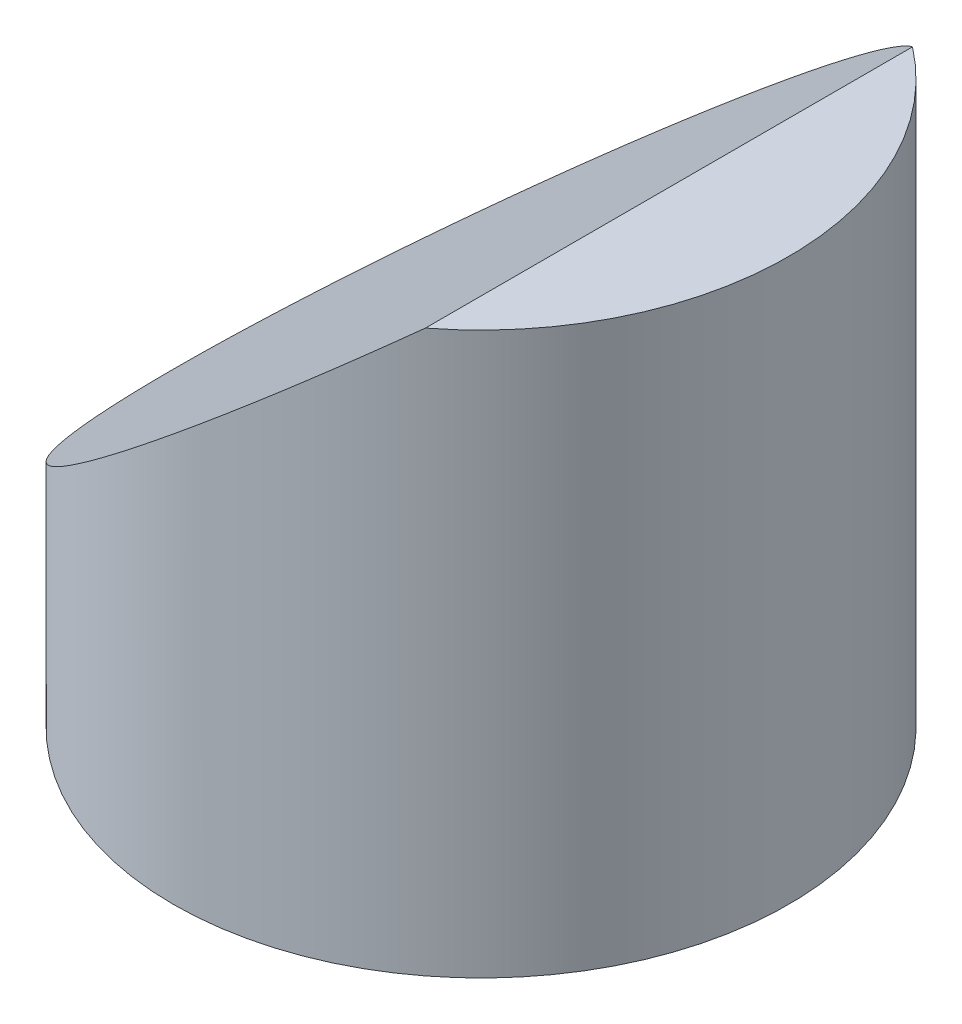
ISO-10303-21;
HEADER;
FILE_DESCRIPTION(('STEP AP214'),'2;1');
FILE_NAME('part.step','',(''),(''),'','','');
FILE_SCHEMA(('AUTOMOTIVE_DESIGN { 1 0 10303 214 1 1 1 1 }'));
ENDSEC;
DATA;
#1=APPLICATION_CONTEXT('core data for automotive mechanical design processes');
#2=APPLICATION_PROTOCOL_DEFINITION('international standard','automotive_design',2000,#1);
#3=PRODUCT_CONTEXT('',#1,'mechanical');
#4=PRODUCT('Part','Part','',(#3));
#5=PRODUCT_RELATED_PRODUCT_CATEGORY('part','',(#4));
#6=PRODUCT_DEFINITION_FORMATION('','',#4);
#7=PRODUCT_DEFINITION_CONTEXT('part definition',#1,'design');
#8=PRODUCT_DEFINITION('design','',#6,#7);
#9=PRODUCT_DEFINITION_SHAPE('','',#8);
#10=(LENGTH_UNIT() NAMED_UNIT(*) SI_UNIT(.MILLI.,.METRE.));
#11=(NAMED_UNIT(*) PLANE_ANGLE_UNIT() SI_UNIT($,.RADIAN.));
#12=(NAMED_UNIT(*) SI_UNIT($,.STERADIAN.) SOLID_ANGLE_UNIT());
#13=UNCERTAINTY_MEASURE_WITH_UNIT(LENGTH_MEASURE(1.E-05),#10,'distance_accuracy_value','');
#14=(GEOMETRIC_REPRESENTATION_CONTEXT(3) GLOBAL_UNCERTAINTY_ASSIGNED_CONTEXT((#13)) GLOBAL_UNIT_ASSIGNED_CONTEXT((#10,
#11,#12)) REPRESENTATION_CONTEXT('',''));
#15=CARTESIAN_POINT('',(0.,0.,0.));
#16=DIRECTION('',(0.,0.,1.));
#17=DIRECTION('',(1.,0.,0.));
#18=AXIS2_PLACEMENT_3D('',#15,#16,#17);
#19=CARTESIAN_POINT('',(0.,80.,0.));
#20=DIRECTION('',(0.,-1.,0.));
#21=DIRECTION('',(0.,0.,-1.));
#22=AXIS2_PLACEMENT_3D('',#19,#20,#21);
#23=CYLINDRICAL_SURFACE('',#22,43.8591986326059);
#24=CARTESIAN_POINT('',(0.,80.,0.));
#25=DIRECTION('',(0.,1.,0.));
#26=DIRECTION('',(0.,0.,1.));
#27=AXIS2_PLACEMENT_3D('',#24,#25,#26);
#28=CIRCLE('',#27,43.8591986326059);
#29=CARTESIAN_POINT('',(26.7971639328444,80.,34.7209059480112));
#30=VERTEX_POINT('',#29);
#31=CARTESIAN_POINT('',(26.7971639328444,80.,-34.7209059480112));
#32=VERTEX_POINT('',#31);
#33=EDGE_CURVE('E51',#30,#32,#28,.T.);
#34=ORIENTED_EDGE('',*,*,#33,.F.);
#35=CARTESIAN_POINT('',(0.,58.0948132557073,0.));
#36=DIRECTION('',(0.632895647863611,-0.774237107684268,0.));
#37=DIRECTION('',(-0.774237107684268,-0.632895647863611,0.));
#38=AXIS2_PLACEMENT_3D('',#35,#36,#37);
#39=ELLIPSE('',#38,56.6482776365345,43.8591986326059);
#40=EDGE_CURVE('E63',#30,#32,#39,.T.);
#41=ORIENTED_EDGE('',*,*,#40,.T.);
#42=EDGE_LOOP('',(#34,#41));
#43=FACE_BOUND('',#42,.T.);
#44=CARTESIAN_POINT('',(0.,0.,0.));
#45=DIRECTION('',(0.,1.,0.));
#46=DIRECTION('',(0.,0.,1.));
#47=AXIS2_PLACEMENT_3D('',#44,#45,#46);
#48=CIRCLE('',#47,43.8591986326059);
#49=CARTESIAN_POINT('',(0.,0.,43.8591986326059));
#50=VERTEX_POINT('',#49);
#51=EDGE_CURVE('E62',#50,#50,#48,.T.);
#52=ORIENTED_EDGE('',*,*,#51,.T.);
#53=EDGE_LOOP('',(#52));
#54=FACE_BOUND('',#53,.T.);
#55=ADVANCED_FACE('F43',(#43,#54),#23,.T.);
#56=CARTESIAN_POINT('',(0.,80.,0.));
#57=DIRECTION('',(0.,1.,0.));
#58=DIRECTION('',(0.,0.,1.));
#59=AXIS2_PLACEMENT_3D('',#56,#57,#58);
#60=PLANE('',#59);
#61=DIRECTION('',(0.,0.,-1.));
#62=VECTOR('',#61,1.);
#63=CARTESIAN_POINT('',(26.7971639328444,80.,0.));
#64=LINE('',#63,#62);
#65=EDGE_CURVE('E11',#30,#32,#64,.T.);
#66=ORIENTED_EDGE('',*,*,#65,.F.);
#67=ORIENTED_EDGE('',*,*,#33,.T.);
#68=EDGE_LOOP('',(#66,#67));
#69=FACE_BOUND('',#68,.T.);
#70=ADVANCED_FACE('F58',(#69),#60,.T.);
#71=CARTESIAN_POINT('',(0.,0.,0.));
#72=DIRECTION('',(0.,1.,0.));
#73=DIRECTION('',(0.,0.,1.));
#74=AXIS2_PLACEMENT_3D('',#71,#72,#73);
#75=PLANE('',#74);
#76=ORIENTED_EDGE('',*,*,#51,.F.);
#77=EDGE_LOOP('',(#76));
#78=FACE_BOUND('',#77,.T.);
#79=ADVANCED_FACE('F70',(#78),#75,.F.);
#80=CARTESIAN_POINT('',(32.027084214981,84.2751681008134,239.337863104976));
#81=DIRECTION('',(0.632895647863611,-0.774237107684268,0.));
#82=DIRECTION('',(0.774237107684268,0.632895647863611,0.));
#83=AXIS2_PLACEMENT_3D('',#80,#81,#82);
#84=PLANE('',#83);
#85=ORIENTED_EDGE('',*,*,#40,.F.);
#86=ORIENTED_EDGE('',*,*,#65,.T.);
#87=EDGE_LOOP('',(#85,#86));
#88=FACE_BOUND('',#87,.T.);
#89=ADVANCED_FACE('F68',(#88),#84,.F.);
#90=CLOSED_SHELL('',(#55,#70,#79,#89));
#91=MANIFOLD_SOLID_BREP('B2',#90);
#92=ADVANCED_BREP_SHAPE_REPRESENTATION('',(#18,#91),#14);
#93=SHAPE_DEFINITION_REPRESENTATION(#9,#92);
ENDSEC;
END-ISO-10303-21;
